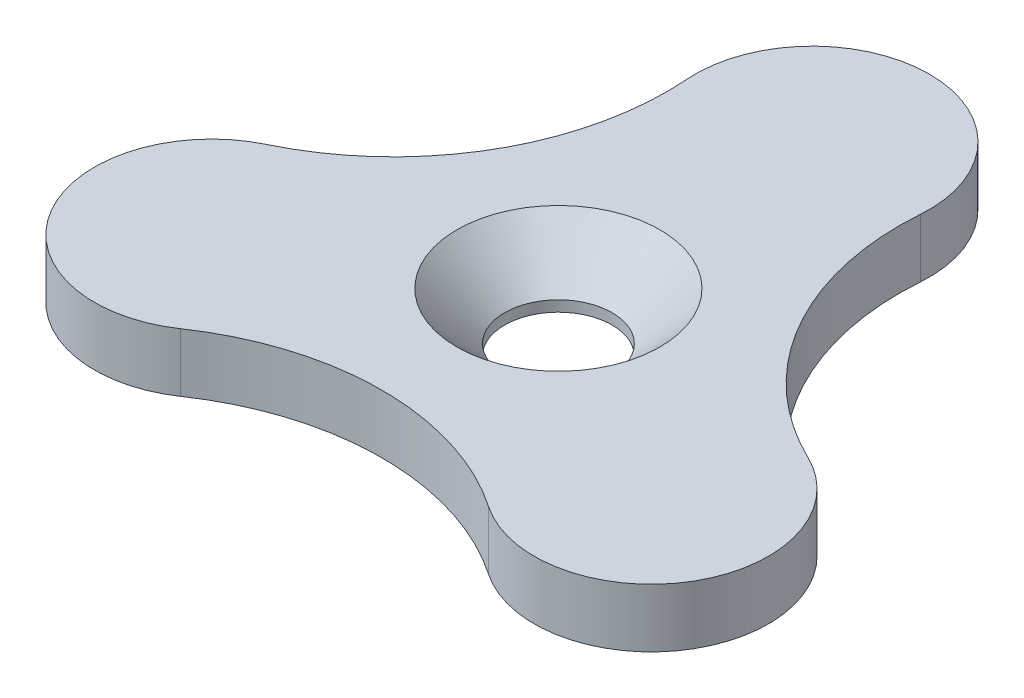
ISO-10303-21;
HEADER;
FILE_DESCRIPTION(('STEP AP214'),'2;1');
FILE_NAME('part.step','',(''),(''),'','','');
FILE_SCHEMA(('AUTOMOTIVE_DESIGN { 1 0 10303 214 1 1 1 1 }'));
ENDSEC;
DATA;
#1=APPLICATION_CONTEXT('core data for automotive mechanical design processes');
#2=APPLICATION_PROTOCOL_DEFINITION('international standard','automotive_design',2000,#1);
#3=PRODUCT_CONTEXT('',#1,'mechanical');
#4=PRODUCT('Part','Part','',(#3));
#5=PRODUCT_RELATED_PRODUCT_CATEGORY('part','',(#4));
#6=PRODUCT_DEFINITION_FORMATION('','',#4);
#7=PRODUCT_DEFINITION_CONTEXT('part definition',#1,'design');
#8=PRODUCT_DEFINITION('design','',#6,#7);
#9=PRODUCT_DEFINITION_SHAPE('','',#8);
#10=(LENGTH_UNIT() NAMED_UNIT(*) SI_UNIT(.MILLI.,.METRE.));
#11=(NAMED_UNIT(*) PLANE_ANGLE_UNIT() SI_UNIT($,.RADIAN.));
#12=(NAMED_UNIT(*) SI_UNIT($,.STERADIAN.) SOLID_ANGLE_UNIT());
#13=UNCERTAINTY_MEASURE_WITH_UNIT(LENGTH_MEASURE(1.E-05),#10,'distance_accuracy_value','');
#14=(GEOMETRIC_REPRESENTATION_CONTEXT(3) GLOBAL_UNCERTAINTY_ASSIGNED_CONTEXT((#13)) GLOBAL_UNIT_ASSIGNED_CONTEXT((#10,
#11,#12)) REPRESENTATION_CONTEXT('',''));
#15=CARTESIAN_POINT('',(0.,0.,0.));
#16=DIRECTION('',(0.,0.,1.));
#17=DIRECTION('',(1.,0.,0.));
#18=AXIS2_PLACEMENT_3D('',#15,#16,#17);
#19=CARTESIAN_POINT('',(19.9448034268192,3.,-11.5151376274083));
#20=DIRECTION('',(0.,-1.,0.));
#21=DIRECTION('',(0.,0.,-1.));
#22=AXIS2_PLACEMENT_3D('',#19,#20,#21);
#23=CYLINDRICAL_SURFACE('',#22,14.);
#24=CARTESIAN_POINT('',(19.9448034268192,0.,-11.5151376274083));
#25=DIRECTION('',(0.,-1.,0.));
#26=DIRECTION('',(0.,0.,1.));
#27=AXIS2_PLACEMENT_3D('',#24,#25,#26);
#28=CIRCLE('',#27,14.);
#29=CARTESIAN_POINT('',(13.8642722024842,0.,1.09545871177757));
#30=VERTEX_POINT('',#29);
#31=CARTESIAN_POINT('',(5.98344102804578,0.,-12.5545412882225));
#32=VERTEX_POINT('',#31);
#33=EDGE_CURVE('E114',#30,#32,#28,.T.);
#34=ORIENTED_EDGE('',*,*,#33,.T.);
#35=DIRECTION('',(0.,-1.,0.));
#36=VECTOR('',#35,1.);
#37=CARTESIAN_POINT('',(5.98344102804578,3.,-12.5545412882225));
#38=LINE('',#37,#36);
#39=CARTESIAN_POINT('',(5.98344102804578,3.,-12.5545412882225));
#40=VERTEX_POINT('',#39);
#41=EDGE_CURVE('E11',#40,#32,#38,.T.);
#42=ORIENTED_EDGE('',*,*,#41,.F.);
#43=CARTESIAN_POINT('',(19.9448034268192,3.,-11.5151376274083));
#44=DIRECTION('',(0.,-1.,0.));
#45=DIRECTION('',(0.,0.,1.));
#46=AXIS2_PLACEMENT_3D('',#43,#44,#45);
#47=CIRCLE('',#46,14.);
#48=CARTESIAN_POINT('',(13.8642722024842,3.,1.09545871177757));
#49=VERTEX_POINT('',#48);
#50=EDGE_CURVE('E125',#49,#40,#47,.T.);
#51=ORIENTED_EDGE('',*,*,#50,.F.);
#52=DIRECTION('',(0.,-1.,0.));
#53=VECTOR('',#52,1.);
#54=CARTESIAN_POINT('',(13.8642722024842,3.,1.09545871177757));
#55=LINE('',#54,#53);
#56=EDGE_CURVE('E110',#49,#30,#55,.T.);
#57=ORIENTED_EDGE('',*,*,#56,.T.);
#58=EDGE_LOOP('',(#34,#42,#51,#57));
#59=FACE_BOUND('',#58,.T.);
#60=ADVANCED_FACE('F30',(#59),#23,.F.);
#61=CARTESIAN_POINT('',(0.,3.,-13.));
#62=DIRECTION('',(0.,-1.,0.));
#63=DIRECTION('',(0.,0.,-1.));
#64=AXIS2_PLACEMENT_3D('',#61,#62,#63);
#65=CYLINDRICAL_SURFACE('',#64,5.99999999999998);
#66=CARTESIAN_POINT('',(0.,0.,-13.));
#67=DIRECTION('',(0.,1.,0.));
#68=DIRECTION('',(0.,0.,1.));
#69=AXIS2_PLACEMENT_3D('',#66,#67,#68);
#70=CIRCLE('',#69,5.99999999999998);
#71=CARTESIAN_POINT('',(-5.98344102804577,0.,-12.5545412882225));
#72=VERTEX_POINT('',#71);
#73=EDGE_CURVE('E117',#32,#72,#70,.T.);
#74=ORIENTED_EDGE('',*,*,#73,.T.);
#75=DIRECTION('',(0.,-1.,0.));
#76=VECTOR('',#75,1.);
#77=CARTESIAN_POINT('',(-5.98344102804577,3.,-12.5545412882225));
#78=LINE('',#77,#76);
#79=CARTESIAN_POINT('',(-5.98344102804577,3.,-12.5545412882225));
#80=VERTEX_POINT('',#79);
#81=EDGE_CURVE('E38',#80,#72,#78,.T.);
#82=ORIENTED_EDGE('',*,*,#81,.F.);
#83=CARTESIAN_POINT('',(0.,3.,-13.));
#84=DIRECTION('',(0.,1.,0.));
#85=DIRECTION('',(0.,0.,1.));
#86=AXIS2_PLACEMENT_3D('',#83,#84,#85);
#87=CIRCLE('',#86,5.99999999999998);
#88=EDGE_CURVE('E83',#40,#80,#87,.T.);
#89=ORIENTED_EDGE('',*,*,#88,.F.);
#90=ORIENTED_EDGE('',*,*,#41,.T.);
#91=EDGE_LOOP('',(#74,#82,#89,#90));
#92=FACE_BOUND('',#91,.T.);
#93=ADVANCED_FACE('F150',(#92),#65,.T.);
#94=CARTESIAN_POINT('',(-19.9448034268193,3.,-11.5151376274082));
#95=DIRECTION('',(0.,-1.,0.));
#96=DIRECTION('',(0.,0.,-1.));
#97=AXIS2_PLACEMENT_3D('',#94,#95,#96);
#98=CYLINDRICAL_SURFACE('',#97,14.);
#99=CARTESIAN_POINT('',(-19.9448034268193,0.,-11.5151376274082));
#100=DIRECTION('',(0.,-1.,0.));
#101=DIRECTION('',(0.,0.,1.));
#102=AXIS2_PLACEMENT_3D('',#99,#100,#101);
#103=CIRCLE('',#102,14.);
#104=CARTESIAN_POINT('',(-13.8642722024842,0.,1.09545871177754));
#105=VERTEX_POINT('',#104);
#106=EDGE_CURVE('E120',#72,#105,#103,.T.);
#107=ORIENTED_EDGE('',*,*,#106,.T.);
#108=DIRECTION('',(0.,-1.,0.));
#109=VECTOR('',#108,1.);
#110=CARTESIAN_POINT('',(-13.8642722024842,3.,1.09545871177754));
#111=LINE('',#110,#109);
#112=CARTESIAN_POINT('',(-13.8642722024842,3.,1.09545871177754));
#113=VERTEX_POINT('',#112);
#114=EDGE_CURVE('E105',#113,#105,#111,.T.);
#115=ORIENTED_EDGE('',*,*,#114,.F.);
#116=CARTESIAN_POINT('',(-19.9448034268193,3.,-11.5151376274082));
#117=DIRECTION('',(0.,-1.,0.));
#118=DIRECTION('',(0.,0.,1.));
#119=AXIS2_PLACEMENT_3D('',#116,#117,#118);
#120=CIRCLE('',#119,14.);
#121=EDGE_CURVE('E96',#80,#113,#120,.T.);
#122=ORIENTED_EDGE('',*,*,#121,.F.);
#123=ORIENTED_EDGE('',*,*,#81,.T.);
#124=EDGE_LOOP('',(#107,#115,#122,#123));
#125=FACE_BOUND('',#124,.T.);
#126=ADVANCED_FACE('F131',(#125),#98,.F.);
#127=CARTESIAN_POINT('',(-11.2583302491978,3.,6.50000000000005));
#128=DIRECTION('',(0.,-1.,0.));
#129=DIRECTION('',(0.,0.,-1.));
#130=AXIS2_PLACEMENT_3D('',#127,#128,#129);
#131=CYLINDRICAL_SURFACE('',#130,6.00000000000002);
#132=CARTESIAN_POINT('',(-11.2583302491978,0.,6.50000000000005));
#133=DIRECTION('',(0.,1.,0.));
#134=DIRECTION('',(0.,0.,1.));
#135=AXIS2_PLACEMENT_3D('',#132,#133,#134);
#136=CIRCLE('',#135,6.00000000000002);
#137=CARTESIAN_POINT('',(-7.8808311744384,0.,11.459082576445));
#138=VERTEX_POINT('',#137);
#139=EDGE_CURVE('E104',#105,#138,#136,.T.);
#140=ORIENTED_EDGE('',*,*,#139,.T.);
#141=DIRECTION('',(0.,-1.,0.));
#142=VECTOR('',#141,1.);
#143=CARTESIAN_POINT('',(-7.8808311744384,3.,11.459082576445));
#144=LINE('',#143,#142);
#145=CARTESIAN_POINT('',(-7.8808311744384,3.,11.459082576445));
#146=VERTEX_POINT('',#145);
#147=EDGE_CURVE('E101',#146,#138,#144,.T.);
#148=ORIENTED_EDGE('',*,*,#147,.F.);
#149=CARTESIAN_POINT('',(-11.2583302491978,3.,6.50000000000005));
#150=DIRECTION('',(0.,1.,0.));
#151=DIRECTION('',(0.,0.,1.));
#152=AXIS2_PLACEMENT_3D('',#149,#150,#151);
#153=CIRCLE('',#152,6.00000000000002);
#154=EDGE_CURVE('E90',#113,#146,#153,.T.);
#155=ORIENTED_EDGE('',*,*,#154,.F.);
#156=ORIENTED_EDGE('',*,*,#114,.T.);
#157=EDGE_LOOP('',(#140,#148,#155,#156));
#158=FACE_BOUND('',#157,.T.);
#159=ADVANCED_FACE('F102',(#158),#131,.T.);
#160=CARTESIAN_POINT('',(0.,3.,23.0302752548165));
#161=DIRECTION('',(0.,-1.,0.));
#162=DIRECTION('',(0.,0.,-1.));
#163=AXIS2_PLACEMENT_3D('',#160,#161,#162);
#164=CYLINDRICAL_SURFACE('',#163,13.9999999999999);
#165=CARTESIAN_POINT('',(0.,0.,23.0302752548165));
#166=DIRECTION('',(0.,-1.,0.));
#167=DIRECTION('',(0.,0.,1.));
#168=AXIS2_PLACEMENT_3D('',#165,#166,#167);
#169=CIRCLE('',#168,13.9999999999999);
#170=CARTESIAN_POINT('',(7.88083117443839,0.,11.459082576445));
#171=VERTEX_POINT('',#170);
#172=EDGE_CURVE('E69',#138,#171,#169,.T.);
#173=ORIENTED_EDGE('',*,*,#172,.T.);
#174=DIRECTION('',(0.,-1.,0.));
#175=VECTOR('',#174,1.);
#176=CARTESIAN_POINT('',(7.88083117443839,3.,11.459082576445));
#177=LINE('',#176,#175);
#178=CARTESIAN_POINT('',(7.88083117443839,3.,11.459082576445));
#179=VERTEX_POINT('',#178);
#180=EDGE_CURVE('E106',#179,#171,#177,.T.);
#181=ORIENTED_EDGE('',*,*,#180,.F.);
#182=CARTESIAN_POINT('',(0.,3.,23.0302752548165));
#183=DIRECTION('',(0.,-1.,0.));
#184=DIRECTION('',(0.,0.,1.));
#185=AXIS2_PLACEMENT_3D('',#182,#183,#184);
#186=CIRCLE('',#185,13.9999999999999);
#187=EDGE_CURVE('E94',#146,#179,#186,.T.);
#188=ORIENTED_EDGE('',*,*,#187,.F.);
#189=ORIENTED_EDGE('',*,*,#147,.T.);
#190=EDGE_LOOP('',(#173,#181,#188,#189));
#191=FACE_BOUND('',#190,.T.);
#192=ADVANCED_FACE('F108',(#191),#164,.F.);
#193=CARTESIAN_POINT('',(11.2583302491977,3.,6.50000000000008));
#194=DIRECTION('',(0.,-1.,0.));
#195=DIRECTION('',(0.,0.,-1.));
#196=AXIS2_PLACEMENT_3D('',#193,#194,#195);
#197=CYLINDRICAL_SURFACE('',#196,6.00000000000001);
#198=CARTESIAN_POINT('',(11.2583302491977,0.,6.50000000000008));
#199=DIRECTION('',(0.,1.,0.));
#200=DIRECTION('',(0.,0.,1.));
#201=AXIS2_PLACEMENT_3D('',#198,#199,#200);
#202=CIRCLE('',#201,6.00000000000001);
#203=EDGE_CURVE('E75',#171,#30,#202,.T.);
#204=ORIENTED_EDGE('',*,*,#203,.T.);
#205=ORIENTED_EDGE('',*,*,#56,.F.);
#206=CARTESIAN_POINT('',(11.2583302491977,3.,6.50000000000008));
#207=DIRECTION('',(0.,1.,0.));
#208=DIRECTION('',(0.,0.,1.));
#209=AXIS2_PLACEMENT_3D('',#206,#207,#208);
#210=CIRCLE('',#209,6.00000000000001);
#211=EDGE_CURVE('E46',#179,#49,#210,.T.);
#212=ORIENTED_EDGE('',*,*,#211,.F.);
#213=ORIENTED_EDGE('',*,*,#180,.T.);
#214=EDGE_LOOP('',(#204,#205,#212,#213));
#215=FACE_BOUND('',#214,.T.);
#216=ADVANCED_FACE('F138',(#215),#197,.T.);
#217=CARTESIAN_POINT('',(15.6015668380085,3.,-2.50756881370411));
#218=DIRECTION('',(0.,1.,0.));
#219=DIRECTION('',(0.,0.,1.));
#220=AXIS2_PLACEMENT_3D('',#217,#218,#219);
#221=PLANE('',#220);
#222=CARTESIAN_POINT('',(0.,3.,0.));
#223=DIRECTION('',(0.,1.,0.));
#224=DIRECTION('',(0.,0.,1.));
#225=AXIS2_PLACEMENT_3D('',#222,#223,#224);
#226=CIRCLE('',#225,5.2);
#227=CARTESIAN_POINT('',(0.,3.,5.2));
#228=VERTEX_POINT('',#227);
#229=EDGE_CURVE('E220',#228,#228,#226,.T.);
#230=ORIENTED_EDGE('',*,*,#229,.F.);
#231=EDGE_LOOP('',(#230));
#232=FACE_BOUND('',#231,.T.);
#233=ORIENTED_EDGE('',*,*,#50,.T.);
#234=ORIENTED_EDGE('',*,*,#88,.T.);
#235=ORIENTED_EDGE('',*,*,#121,.T.);
#236=ORIENTED_EDGE('',*,*,#154,.T.);
#237=ORIENTED_EDGE('',*,*,#187,.T.);
#238=ORIENTED_EDGE('',*,*,#211,.T.);
#239=EDGE_LOOP('',(#233,#234,#235,#236,#237,#238));
#240=FACE_BOUND('',#239,.T.);
#241=ADVANCED_FACE('F92',(#232,#240),#221,.T.);
#242=CARTESIAN_POINT('',(15.6015668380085,0.,-2.50756881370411));
#243=DIRECTION('',(0.,1.,0.));
#244=DIRECTION('',(0.,0.,1.));
#245=AXIS2_PLACEMENT_3D('',#242,#243,#244);
#246=PLANE('',#245);
#247=CARTESIAN_POINT('',(0.,0.,0.));
#248=DIRECTION('',(0.,1.,0.));
#249=DIRECTION('',(0.,0.,1.));
#250=AXIS2_PLACEMENT_3D('',#247,#248,#249);
#251=CIRCLE('',#250,2.75);
#252=CARTESIAN_POINT('',(0.,0.,2.75));
#253=VERTEX_POINT('',#252);
#254=EDGE_CURVE('E118',#253,#253,#251,.T.);
#255=ORIENTED_EDGE('',*,*,#254,.T.);
#256=EDGE_LOOP('',(#255));
#257=FACE_BOUND('',#256,.T.);
#258=ORIENTED_EDGE('',*,*,#33,.F.);
#259=ORIENTED_EDGE('',*,*,#203,.F.);
#260=ORIENTED_EDGE('',*,*,#172,.F.);
#261=ORIENTED_EDGE('',*,*,#139,.F.);
#262=ORIENTED_EDGE('',*,*,#106,.F.);
#263=ORIENTED_EDGE('',*,*,#73,.F.);
#264=EDGE_LOOP('',(#258,#259,#260,#261,#262,#263));
#265=FACE_BOUND('',#264,.T.);
#266=ADVANCED_FACE('F134',(#257,#265),#246,.F.);
#267=CARTESIAN_POINT('',(0.,3.,0.));
#268=DIRECTION('',(0.,1.,0.));
#269=DIRECTION('',(0.,0.,1.));
#270=AXIS2_PLACEMENT_3D('',#267,#268,#269);
#271=CYLINDRICAL_SURFACE('',#270,2.74999999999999);
#272=ORIENTED_EDGE('',*,*,#254,.F.);
#273=EDGE_LOOP('',(#272));
#274=FACE_BOUND('',#273,.T.);
#275=CARTESIAN_POINT('',(0.,0.549999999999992,0.));
#276=DIRECTION('',(0.,1.,0.));
#277=DIRECTION('',(0.,0.,1.));
#278=AXIS2_PLACEMENT_3D('',#275,#276,#277);
#279=CIRCLE('',#278,2.74999999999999);
#280=CARTESIAN_POINT('',(0.,0.549999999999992,2.74999999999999));
#281=VERTEX_POINT('',#280);
#282=EDGE_CURVE('E217',#281,#281,#279,.T.);
#283=ORIENTED_EDGE('',*,*,#282,.T.);
#284=EDGE_LOOP('',(#283));
#285=FACE_BOUND('',#284,.T.);
#286=ADVANCED_FACE('F190',(#274,#285),#271,.F.);
#287=CARTESIAN_POINT('',(0.,3.,0.));
#288=DIRECTION('',(0.,1.,0.));
#289=DIRECTION('',(0.,0.,1.));
#290=AXIS2_PLACEMENT_3D('',#287,#288,#289);
#291=CONICAL_SURFACE('',#290,5.2,0.785398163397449);
#292=ORIENTED_EDGE('',*,*,#282,.F.);
#293=EDGE_LOOP('',(#292));
#294=FACE_BOUND('',#293,.T.);
#295=ORIENTED_EDGE('',*,*,#229,.T.);
#296=EDGE_LOOP('',(#295));
#297=FACE_BOUND('',#296,.T.);
#298=ADVANCED_FACE('F200',(#294,#297),#291,.F.);
#299=CLOSED_SHELL('',(#60,#93,#126,#159,#192,#216,#241,#266,#286,#298));
#300=MANIFOLD_SOLID_BREP('B2',#299);
#301=ADVANCED_BREP_SHAPE_REPRESENTATION('',(#18,#300),#14);
#302=SHAPE_DEFINITION_REPRESENTATION(#9,#301);
ENDSEC;
END-ISO-10303-21;
